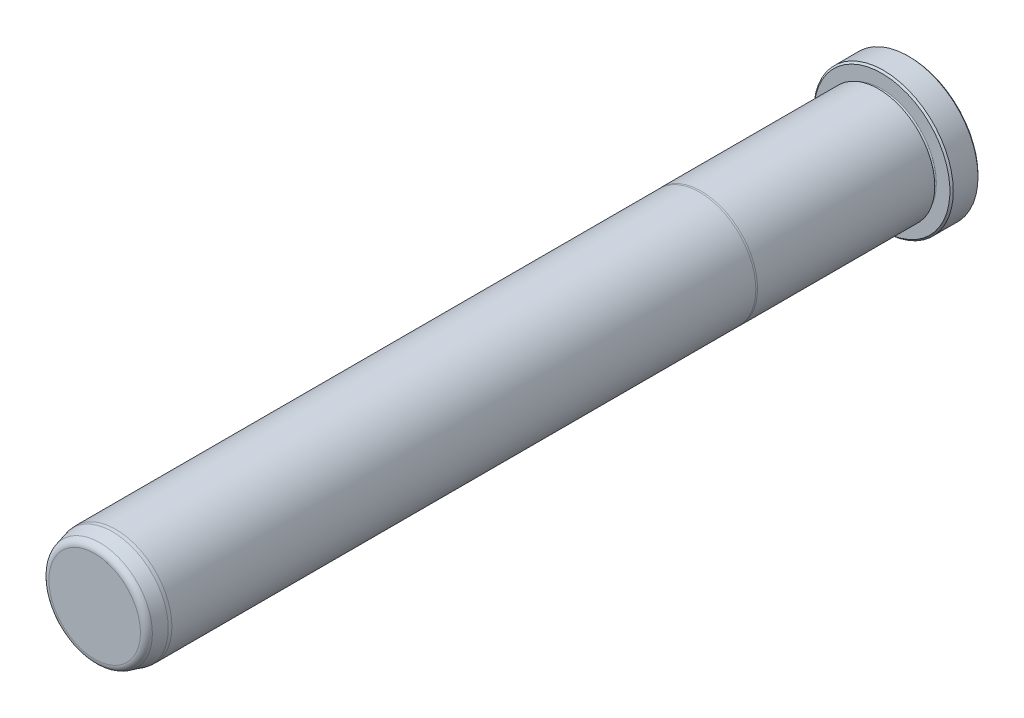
ISO-10303-21;
HEADER;
FILE_DESCRIPTION(('STEP AP214'),'2;1');
FILE_NAME('part.step','',(''),(''),'','','');
FILE_SCHEMA(('AUTOMOTIVE_DESIGN { 1 0 10303 214 1 1 1 1 }'));
ENDSEC;
DATA;
#1=APPLICATION_CONTEXT('core data for automotive mechanical design processes');
#2=APPLICATION_PROTOCOL_DEFINITION('international standard','automotive_design',2000,#1);
#3=PRODUCT_CONTEXT('',#1,'mechanical');
#4=PRODUCT('Part','Part','',(#3));
#5=PRODUCT_RELATED_PRODUCT_CATEGORY('part','',(#4));
#6=PRODUCT_DEFINITION_FORMATION('','',#4);
#7=PRODUCT_DEFINITION_CONTEXT('part definition',#1,'design');
#8=PRODUCT_DEFINITION('design','',#6,#7);
#9=PRODUCT_DEFINITION_SHAPE('','',#8);
#10=(LENGTH_UNIT() NAMED_UNIT(*) SI_UNIT(.MILLI.,.METRE.));
#11=(NAMED_UNIT(*) PLANE_ANGLE_UNIT() SI_UNIT($,.RADIAN.));
#12=(NAMED_UNIT(*) SI_UNIT($,.STERADIAN.) SOLID_ANGLE_UNIT());
#13=UNCERTAINTY_MEASURE_WITH_UNIT(LENGTH_MEASURE(1.E-05),#10,'distance_accuracy_value','');
#14=(GEOMETRIC_REPRESENTATION_CONTEXT(3) GLOBAL_UNCERTAINTY_ASSIGNED_CONTEXT((#13)) GLOBAL_UNIT_ASSIGNED_CONTEXT((#10,
#11,#12)) REPRESENTATION_CONTEXT('',''));
#15=CARTESIAN_POINT('',(0.,0.,0.));
#16=DIRECTION('',(0.,0.,1.));
#17=DIRECTION('',(1.,0.,0.));
#18=AXIS2_PLACEMENT_3D('',#15,#16,#17);
#19=CARTESIAN_POINT('',(0.,0.,0.));
#20=DIRECTION('',(0.,0.,1.));
#21=DIRECTION('',(1.,0.,0.));
#22=AXIS2_PLACEMENT_3D('',#19,#20,#21);
#23=PLANE('',#22);
#24=CARTESIAN_POINT('',(0.,0.,0.));
#25=DIRECTION('',(0.,0.,1.));
#26=DIRECTION('',(1.,0.,0.));
#27=AXIS2_PLACEMENT_3D('',#24,#25,#26);
#28=CIRCLE('',#27,15.3669999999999);
#29=CARTESIAN_POINT('',(15.3669999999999,0.,0.));
#30=VERTEX_POINT('',#29);
#31=EDGE_CURVE('E37',#30,#30,#28,.F.);
#32=ORIENTED_EDGE('',*,*,#31,.T.);
#33=EDGE_LOOP('',(#32));
#34=FACE_BOUND('',#33,.T.);
#35=ADVANCED_FACE('F30',(#34),#23,.F.);
#36=CARTESIAN_POINT('',(0.,0.,0.));
#37=DIRECTION('',(0.,0.,1.));
#38=DIRECTION('',(1.,0.,0.));
#39=AXIS2_PLACEMENT_3D('',#36,#37,#38);
#40=CYLINDRICAL_SURFACE('',#39,15.748);
#41=CARTESIAN_POINT('',(0.,0.,0.38100000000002));
#42=DIRECTION('',(0.,0.,1.));
#43=DIRECTION('',(1.,0.,0.));
#44=AXIS2_PLACEMENT_3D('',#41,#42,#43);
#45=CIRCLE('',#44,15.748);
#46=CARTESIAN_POINT('',(15.748,0.,0.38100000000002));
#47=VERTEX_POINT('',#46);
#48=EDGE_CURVE('E41',#47,#47,#45,.T.);
#49=ORIENTED_EDGE('',*,*,#48,.T.);
#50=EDGE_LOOP('',(#49));
#51=FACE_BOUND('',#50,.T.);
#52=CARTESIAN_POINT('',(0.,0.,5.96900000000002));
#53=DIRECTION('',(0.,0.,-1.));
#54=DIRECTION('',(-1.,0.,0.));
#55=AXIS2_PLACEMENT_3D('',#52,#53,#54);
#56=CIRCLE('',#55,15.748);
#57=CARTESIAN_POINT('',(-15.748,0.,5.96900000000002));
#58=VERTEX_POINT('',#57);
#59=EDGE_CURVE('E45',#58,#58,#56,.T.);
#60=ORIENTED_EDGE('',*,*,#59,.T.);
#61=EDGE_LOOP('',(#60));
#62=FACE_BOUND('',#61,.T.);
#63=ADVANCED_FACE('F118',(#51,#62),#40,.T.);
#64=CARTESIAN_POINT('',(0.,15.748,6.35));
#65=DIRECTION('',(0.,0.,-1.));
#66=DIRECTION('',(-1.,0.,0.));
#67=AXIS2_PLACEMENT_3D('',#64,#65,#66);
#68=PLANE('',#67);
#69=CARTESIAN_POINT('',(0.,0.,6.35));
#70=DIRECTION('',(0.,0.,-1.));
#71=DIRECTION('',(-1.,0.,0.));
#72=AXIS2_PLACEMENT_3D('',#69,#70,#71);
#73=CIRCLE('',#72,15.367);
#74=CARTESIAN_POINT('',(-15.367,0.,6.35));
#75=VERTEX_POINT('',#74);
#76=EDGE_CURVE('E10',#75,#75,#73,.F.);
#77=ORIENTED_EDGE('',*,*,#76,.T.);
#78=EDGE_LOOP('',(#77));
#79=FACE_BOUND('',#78,.T.);
#80=CARTESIAN_POINT('',(0.,0.,6.35));
#81=DIRECTION('',(0.,0.,1.));
#82=DIRECTION('',(1.,0.,0.));
#83=AXIS2_PLACEMENT_3D('',#80,#81,#82);
#84=CIRCLE('',#83,12.3063);
#85=CARTESIAN_POINT('',(12.3063,0.,6.35));
#86=VERTEX_POINT('',#85);
#87=EDGE_CURVE('E56',#86,#86,#84,.T.);
#88=ORIENTED_EDGE('',*,*,#87,.F.);
#89=EDGE_LOOP('',(#88));
#90=FACE_BOUND('',#89,.T.);
#91=ADVANCED_FACE('F113',(#79,#90),#68,.F.);
#92=CARTESIAN_POINT('',(0.,0.,6.731));
#93=DIRECTION('',(0.,0.,1.));
#94=DIRECTION('',(1.,0.,0.));
#95=AXIS2_PLACEMENT_3D('',#92,#93,#94);
#96=TOROIDAL_SURFACE('',#95,12.3063,0.381);
#97=CARTESIAN_POINT('',(0.,0.,7.112));
#98=DIRECTION('',(0.,0.,1.));
#99=DIRECTION('',(1.,0.,0.));
#100=AXIS2_PLACEMENT_3D('',#97,#98,#99);
#101=CIRCLE('',#100,12.3063);
#102=CARTESIAN_POINT('',(12.3063,0.,7.112));
#103=VERTEX_POINT('',#102);
#104=EDGE_CURVE('E59',#103,#103,#101,.T.);
#105=ORIENTED_EDGE('',*,*,#104,.F.);
#106=EDGE_LOOP('',(#105));
#107=FACE_BOUND('',#106,.T.);
#108=ORIENTED_EDGE('',*,*,#87,.T.);
#109=EDGE_LOOP('',(#108));
#110=FACE_BOUND('',#109,.T.);
#111=ADVANCED_FACE('F107',(#107,#110),#96,.F.);
#112=CARTESIAN_POINT('',(0.,12.3063,7.112));
#113=DIRECTION('',(0.,0.,1.));
#114=DIRECTION('',(1.,0.,0.));
#115=AXIS2_PLACEMENT_3D('',#112,#113,#114);
#116=PLANE('',#115);
#117=CARTESIAN_POINT('',(0.,0.,7.112));
#118=DIRECTION('',(0.,0.,1.));
#119=DIRECTION('',(1.,0.,0.));
#120=AXIS2_PLACEMENT_3D('',#117,#118,#119);
#121=CIRCLE('',#120,12.7127);
#122=CARTESIAN_POINT('',(12.7127,0.,7.112));
#123=VERTEX_POINT('',#122);
#124=EDGE_CURVE('E62',#123,#123,#121,.T.);
#125=ORIENTED_EDGE('',*,*,#124,.F.);
#126=EDGE_LOOP('',(#125));
#127=FACE_BOUND('',#126,.T.);
#128=ORIENTED_EDGE('',*,*,#104,.T.);
#129=EDGE_LOOP('',(#128));
#130=FACE_BOUND('',#129,.T.);
#131=ADVANCED_FACE('F101',(#127,#130),#116,.F.);
#132=CARTESIAN_POINT('',(0.,0.,0.));
#133=DIRECTION('',(0.,0.,1.));
#134=DIRECTION('',(1.,0.,0.));
#135=AXIS2_PLACEMENT_3D('',#132,#133,#134);
#136=CYLINDRICAL_SURFACE('',#135,12.7127);
#137=CARTESIAN_POINT('',(0.,0.,47.1347630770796));
#138=DIRECTION('',(0.,0.,1.));
#139=DIRECTION('',(1.,0.,0.));
#140=AXIS2_PLACEMENT_3D('',#137,#138,#139);
#141=CIRCLE('',#140,12.7127);
#142=CARTESIAN_POINT('',(12.7127,0.,47.1347630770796));
#143=VERTEX_POINT('',#142);
#144=EDGE_CURVE('E65',#143,#143,#141,.T.);
#145=ORIENTED_EDGE('',*,*,#144,.F.);
#146=EDGE_LOOP('',(#145));
#147=FACE_BOUND('',#146,.T.);
#148=ORIENTED_EDGE('',*,*,#124,.T.);
#149=EDGE_LOOP('',(#148));
#150=FACE_BOUND('',#149,.T.);
#151=ADVANCED_FACE('F95',(#147,#150),#136,.T.);
#152=CARTESIAN_POINT('',(0.,0.,47.1347630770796));
#153=DIRECTION('',(0.,0.,-1.));
#154=DIRECTION('',(-1.,0.,0.));
#155=AXIS2_PLACEMENT_3D('',#152,#153,#154);
#156=CONICAL_SURFACE('',#155,12.7127,0.0698131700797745);
#157=CARTESIAN_POINT('',(0.,0.,47.498));
#158=DIRECTION('',(0.,0.,1.));
#159=DIRECTION('',(1.,0.,0.));
#160=AXIS2_PLACEMENT_3D('',#157,#158,#159);
#161=CIRCLE('',#160,12.6873);
#162=CARTESIAN_POINT('',(12.6873,0.,47.498));
#163=VERTEX_POINT('',#162);
#164=EDGE_CURVE('E68',#163,#163,#161,.T.);
#165=ORIENTED_EDGE('',*,*,#164,.F.);
#166=EDGE_LOOP('',(#165));
#167=FACE_BOUND('',#166,.T.);
#168=ORIENTED_EDGE('',*,*,#144,.T.);
#169=EDGE_LOOP('',(#168));
#170=FACE_BOUND('',#169,.T.);
#171=ADVANCED_FACE('F89',(#167,#170),#156,.T.);
#172=CARTESIAN_POINT('',(0.,0.,0.));
#173=DIRECTION('',(0.,0.,1.));
#174=DIRECTION('',(1.,0.,0.));
#175=AXIS2_PLACEMENT_3D('',#172,#173,#174);
#176=CYLINDRICAL_SURFACE('',#175,12.6873);
#177=CARTESIAN_POINT('',(0.,0.,179.3875));
#178=DIRECTION('',(0.,0.,1.));
#179=DIRECTION('',(1.,0.,0.));
#180=AXIS2_PLACEMENT_3D('',#177,#178,#179);
#181=CIRCLE('',#180,12.6873);
#182=CARTESIAN_POINT('',(12.6873,0.,179.3875));
#183=VERTEX_POINT('',#182);
#184=EDGE_CURVE('E71',#183,#183,#181,.T.);
#185=ORIENTED_EDGE('',*,*,#184,.F.);
#186=EDGE_LOOP('',(#185));
#187=FACE_BOUND('',#186,.T.);
#188=ORIENTED_EDGE('',*,*,#164,.T.);
#189=EDGE_LOOP('',(#188));
#190=FACE_BOUND('',#189,.T.);
#191=ADVANCED_FACE('F83',(#187,#190),#176,.T.);
#192=CARTESIAN_POINT('',(0.,0.,179.3875));
#193=DIRECTION('',(0.,0.,-1.));
#194=DIRECTION('',(-1.,0.,0.));
#195=AXIS2_PLACEMENT_3D('',#192,#193,#194);
#196=CONICAL_SURFACE('',#195,12.6873,0.0872664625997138);
#197=CARTESIAN_POINT('',(0.,0.,180.1495));
#198=DIRECTION('',(0.,0.,1.));
#199=DIRECTION('',(1.,0.,0.));
#200=AXIS2_PLACEMENT_3D('',#197,#198,#199);
#201=CIRCLE('',#200,12.6206336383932);
#202=CARTESIAN_POINT('',(12.6206336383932,0.,180.1495));
#203=VERTEX_POINT('',#202);
#204=EDGE_CURVE('E74',#203,#203,#201,.T.);
#205=ORIENTED_EDGE('',*,*,#204,.F.);
#206=EDGE_LOOP('',(#205));
#207=FACE_BOUND('',#206,.T.);
#208=ORIENTED_EDGE('',*,*,#184,.T.);
#209=EDGE_LOOP('',(#208));
#210=FACE_BOUND('',#209,.T.);
#211=ADVANCED_FACE('F80',(#207,#210),#196,.T.);
#212=CARTESIAN_POINT('',(0.,0.,180.1495));
#213=DIRECTION('',(0.,0.,-1.));
#214=DIRECTION('',(-1.,0.,0.));
#215=AXIS2_PLACEMENT_3D('',#212,#213,#214);
#216=CONICAL_SURFACE('',#215,12.6206336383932,0.26179938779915);
#217=CARTESIAN_POINT('',(0.,0.,182.9733752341));
#218=DIRECTION('',(0.,0.,1.));
#219=DIRECTION('',(1.,0.,0.));
#220=AXIS2_PLACEMENT_3D('',#217,#218,#219);
#221=CIRCLE('',#220,11.8639785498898);
#222=CARTESIAN_POINT('',(11.8639785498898,0.,182.9733752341));
#223=VERTEX_POINT('',#222);
#224=EDGE_CURVE('E50',#223,#223,#221,.F.);
#225=ORIENTED_EDGE('',*,*,#224,.T.);
#226=EDGE_LOOP('',(#225));
#227=FACE_BOUND('',#226,.T.);
#228=ORIENTED_EDGE('',*,*,#204,.T.);
#229=EDGE_LOOP('',(#228));
#230=FACE_BOUND('',#229,.T.);
#231=ADVANCED_FACE('F78',(#227,#230),#216,.T.);
#232=CARTESIAN_POINT('',(0.,11.5487028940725,184.15));
#233=DIRECTION('',(0.,0.,-1.));
#234=DIRECTION('',(-1.,0.,0.));
#235=AXIS2_PLACEMENT_3D('',#232,#233,#234);
#236=PLANE('',#235);
#237=CARTESIAN_POINT('',(0.,0.,184.15));
#238=DIRECTION('',(0.,0.,-1.));
#239=DIRECTION('',(-1.,0.,0.));
#240=AXIS2_PLACEMENT_3D('',#237,#238,#239);
#241=CIRCLE('',#240,10.3305713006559);
#242=CARTESIAN_POINT('',(-10.3305713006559,0.,184.15));
#243=VERTEX_POINT('',#242);
#244=EDGE_CURVE('E53',#243,#243,#241,.F.);
#245=ORIENTED_EDGE('',*,*,#244,.T.);
#246=EDGE_LOOP('',(#245));
#247=FACE_BOUND('',#246,.T.);
#248=ADVANCED_FACE('F133',(#247),#236,.F.);
#249=CARTESIAN_POINT('',(0.,0.,182.5625));
#250=DIRECTION('',(0.,0.,-1.));
#251=DIRECTION('',(-1.,0.,0.));
#252=AXIS2_PLACEMENT_3D('',#249,#250,#251);
#253=TOROIDAL_SURFACE('',#252,10.3305713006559,1.5875);
#254=ORIENTED_EDGE('',*,*,#224,.F.);
#255=EDGE_LOOP('',(#254));
#256=FACE_BOUND('',#255,.T.);
#257=ORIENTED_EDGE('',*,*,#244,.F.);
#258=EDGE_LOOP('',(#257));
#259=FACE_BOUND('',#258,.T.);
#260=ADVANCED_FACE('F130',(#256,#259),#253,.T.);
#261=CARTESIAN_POINT('',(0.,0.,0.38100000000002));
#262=DIRECTION('',(0.,0.,1.));
#263=DIRECTION('',(1.,0.,0.));
#264=AXIS2_PLACEMENT_3D('',#261,#262,#263);
#265=CONICAL_SURFACE('',#264,15.748,0.785398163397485);
#266=ORIENTED_EDGE('',*,*,#31,.F.);
#267=EDGE_LOOP('',(#266));
#268=FACE_BOUND('',#267,.T.);
#269=ORIENTED_EDGE('',*,*,#48,.F.);
#270=EDGE_LOOP('',(#269));
#271=FACE_BOUND('',#270,.T.);
#272=ADVANCED_FACE('F132',(#268,#271),#265,.T.);
#273=CARTESIAN_POINT('',(0.,0.,6.35));
#274=DIRECTION('',(0.,0.,-1.));
#275=DIRECTION('',(-1.,0.,0.));
#276=AXIS2_PLACEMENT_3D('',#273,#274,#275);
#277=CONICAL_SURFACE('',#276,15.367,0.785398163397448);
#278=ORIENTED_EDGE('',*,*,#59,.F.);
#279=EDGE_LOOP('',(#278));
#280=FACE_BOUND('',#279,.T.);
#281=ORIENTED_EDGE('',*,*,#76,.F.);
#282=EDGE_LOOP('',(#281));
#283=FACE_BOUND('',#282,.T.);
#284=ADVANCED_FACE('F32',(#280,#283),#277,.T.);
#285=CLOSED_SHELL('',(#35,#63,#91,#111,#131,#151,#171,#191,#211,#231,#248,#260,#272,#284));
#286=MANIFOLD_SOLID_BREP('B2',#285);
#287=ADVANCED_BREP_SHAPE_REPRESENTATION('',(#18,#286),#14);
#288=SHAPE_DEFINITION_REPRESENTATION(#9,#287);
ENDSEC;
END-ISO-10303-21;
